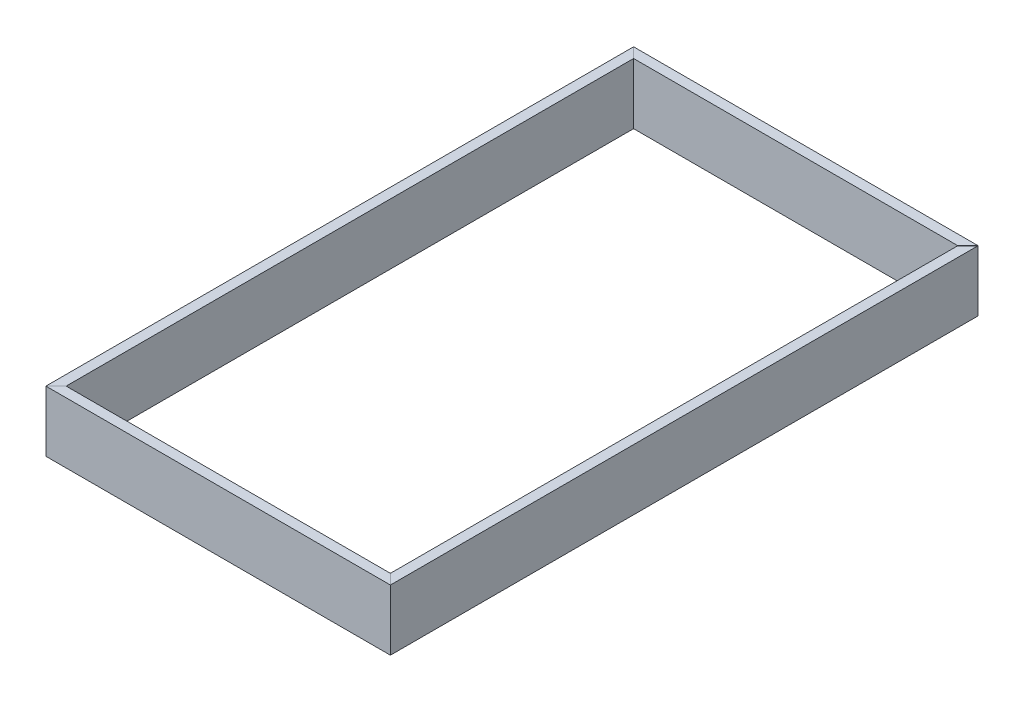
from build123d import *

# Parameters (mm, degrees)
BOSS_EXTRUDE1_DEPTH   = 88.9
BOSS_EXTRUDE1_2_DEPTH = 88.9
SKETCH2_W             = 139.7
SKETCH2_H             = 19.05
BOSS_EXTRUDE2_DEPTH   = 3.175
SKETCH3_W             = 107.95
SKETCH3_H             = 3.175
BOSS_EXTRUDE3_DEPTH   = 15.875
CUT_EXTRUDE1_DEPTH    = 178.573069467
SKETCH5_W             = 177.679211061
SKETCH5_H             = 251.71221567
SKETCH5_W_2           = 107.95
SKETCH5_H_2           = 184.15
CUT_EXTRUDE2_DEPTH    = 178.260565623


with BuildPart() as part:
    # Sketch1 → Boss-Extrude1 (new, symmetric)
    with BuildSketch(Plane.XY):
        Polygon((0, 0), (19.05, 0), (19.05, -19.05), (15.875, -19.05), (15.875, -3.175), (0, -3.175), align=None)
    extrude(amount=BOSS_EXTRUDE1_DEPTH, both=True)



with BuildPart() as body_2:
    # Sketch1 → Boss-Extrude1 2 (new, symmetric)
    with BuildSketch(Plane.XY):
        Polygon((123.825, -19.05), (120.65, -19.05), (120.65, 0), (139.7, 0), (139.7, -3.175), (123.825, -3.175), align=None)
    extrude(amount=BOSS_EXTRUDE1_2_DEPTH, both=True)


with BuildPart() as part_1:
    add(part.part)

    add(body_2.part)  # Boss-Extrude2 merges body 2
    # Sketch2 → Boss-Extrude2 (add)
    with BuildSketch(Plane(origin=(0, 0, 0), x_dir=(1, 0, 0), z_dir=(0, 1, 0))):
        with Locations((69.85, 98.425)):
            Rectangle(SKETCH2_W, SKETCH2_H)
        with Locations((69.85, -98.425)):
            Rectangle(SKETCH2_W, SKETCH2_H)
    extrude(amount=-BOSS_EXTRUDE2_DEPTH)

    # Sketch3 → Boss-Extrude3 (add)
    with BuildSketch(Plane.XZ.offset(3.175)):
        with Locations((69.85, 90.4875)):
            Rectangle(SKETCH3_W, SKETCH3_H)
        with Locations((69.85, -90.4875)):
            Rectangle(SKETCH3_W, SKETCH3_H)
    extrude(amount=BOSS_EXTRUDE3_DEPTH)

    # Sketch4 → Cut-Extrude1 (cut, through all)
    with BuildSketch(Plane(origin=(0, 0, 0), x_dir=(1, 0, 0), z_dir=(0, 1, 0))):
        Polygon((-0.017960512, 107.932039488), (19.032039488, 88.882039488), (24.022036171, 83.892042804), (24.057957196, 83.927963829), (19.067960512, 88.917960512), (0.017960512, 107.967960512), align=None)
        Polygon((115.677963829, 83.892042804), (115.642042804, 83.927963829), (120.632039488, 88.917960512), (139.682039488, 107.967960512), (139.717960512, 107.932039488), (120.667960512, 88.882039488), align=None)
        Polygon((139.717960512, -107.932039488), (120.667960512, -88.882039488), (115.677963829, -83.892042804), (115.642042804, -83.927963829), (120.632039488, -88.917960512), (139.682039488, -107.967960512), align=None)
        Polygon((24.022036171, -83.892042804), (24.057957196, -83.927963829), (19.067960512, -88.917960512), (0.017960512, -107.967960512), (-0.017960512, -107.932039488), (19.032039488, -88.882039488), align=None)
    extrude(amount=-CUT_EXTRUDE1_DEPTH, mode=Mode.SUBTRACT)


with BuildPart() as cut_extrude1_piece_1:
    # of the separate pieces the step leaves, piece 1, a body of its own (cut_extrude1_pieces)
    add(part_1.part.solids().sort_by_distance((0, 0, -107.914078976))[0])


with BuildPart() as cut_extrude1_piece_2:
    # of the separate pieces the step leaves, piece 2, a body of its own (cut_extrude1_pieces)
    add(part_1.part.solids().sort_by_distance((139.7, 0, -107.914078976))[0])


with BuildPart() as cut_extrude1_piece_3:
    # of the separate pieces the step leaves, piece 3, a body of its own (cut_extrude1_pieces)
    add(part_1.part.solids().sort_by_distance((0.035921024, 0, -107.95))[0])


with BuildPart() as cut_extrude1_piece_4:
    # of the separate pieces the step leaves, piece 4, a body of its own (cut_extrude1_pieces)
    add(part_1.part.solids().sort_by_distance((139.664078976, 0, 107.95))[0])


with BuildPart() as cut_extrude2_tool:
    # Sketch5 → Cut-Extrude2 (new, through all)
    with BuildSketch(Plane.XZ.offset(3.175)):
        with Locations((76.094420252, -1.80492848)):
            Rectangle(SKETCH5_W, SKETCH5_H)
        with Locations((69.85, 0)):
            Rectangle(SKETCH5_W_2, SKETCH5_H_2, mode=Mode.SUBTRACT)
    extrude(amount=-CUT_EXTRUDE2_DEPTH)


with BuildPart() as cut_extrude1_piece_1_1:
    add(cut_extrude1_piece_1.part)

    # Cut-Extrude2: cut by cut_extrude2_tool
    add(cut_extrude2_tool.part, mode=Mode.SUBTRACT)


with BuildPart() as cut_extrude1_piece_2_1:
    add(cut_extrude1_piece_2.part)

    # Cut-Extrude2: cut by cut_extrude2_tool
    add(cut_extrude2_tool.part, mode=Mode.SUBTRACT)


with BuildPart() as cut_extrude1_piece_3_1:
    add(cut_extrude1_piece_3.part)

    # Cut-Extrude2: cut by cut_extrude2_tool
    add(cut_extrude2_tool.part, mode=Mode.SUBTRACT)


with BuildPart() as cut_extrude1_piece_4_1:
    add(cut_extrude1_piece_4.part)

    # Cut-Extrude2: cut by cut_extrude2_tool
    add(cut_extrude2_tool.part, mode=Mode.SUBTRACT)


solid = Compound([cut_extrude1_piece_1_1.part, cut_extrude1_piece_2_1.part, cut_extrude1_piece_3_1.part, cut_extrude1_piece_4_1.part])
